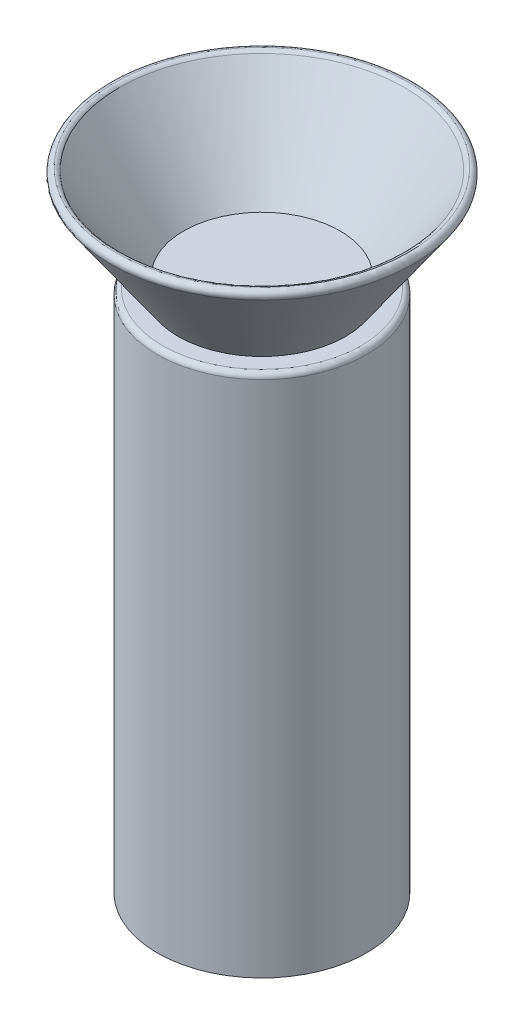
ISO-10303-21;
HEADER;
FILE_DESCRIPTION(('STEP AP214'),'2;1');
FILE_NAME('part.step','',(''),(''),'','','');
FILE_SCHEMA(('AUTOMOTIVE_DESIGN { 1 0 10303 214 1 1 1 1 }'));
ENDSEC;
DATA;
#1=APPLICATION_CONTEXT('core data for automotive mechanical design processes');
#2=APPLICATION_PROTOCOL_DEFINITION('international standard','automotive_design',2000,#1);
#3=PRODUCT_CONTEXT('',#1,'mechanical');
#4=PRODUCT('Part','Part','',(#3));
#5=PRODUCT_RELATED_PRODUCT_CATEGORY('part','',(#4));
#6=PRODUCT_DEFINITION_FORMATION('','',#4);
#7=PRODUCT_DEFINITION_CONTEXT('part definition',#1,'design');
#8=PRODUCT_DEFINITION('design','',#6,#7);
#9=PRODUCT_DEFINITION_SHAPE('','',#8);
#10=(LENGTH_UNIT() NAMED_UNIT(*) SI_UNIT(.MILLI.,.METRE.));
#11=(NAMED_UNIT(*) PLANE_ANGLE_UNIT() SI_UNIT($,.RADIAN.));
#12=(NAMED_UNIT(*) SI_UNIT($,.STERADIAN.) SOLID_ANGLE_UNIT());
#13=UNCERTAINTY_MEASURE_WITH_UNIT(LENGTH_MEASURE(1.E-05),#10,'distance_accuracy_value','');
#14=(GEOMETRIC_REPRESENTATION_CONTEXT(3) GLOBAL_UNCERTAINTY_ASSIGNED_CONTEXT((#13)) GLOBAL_UNIT_ASSIGNED_CONTEXT((#10,
#11,#12)) REPRESENTATION_CONTEXT('',''));
#15=CARTESIAN_POINT('',(0.,0.,0.));
#16=DIRECTION('',(0.,0.,1.));
#17=DIRECTION('',(1.,0.,0.));
#18=AXIS2_PLACEMENT_3D('',#15,#16,#17);
#19=CARTESIAN_POINT('',(0.,120.,0.));
#20=DIRECTION('',(0.,1.,0.));
#21=DIRECTION('',(0.,0.,1.));
#22=AXIS2_PLACEMENT_3D('',#19,#20,#21);
#23=CONICAL_SURFACE('',#22,30.,0.610865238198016);
#24=CARTESIAN_POINT('',(0.,118.426423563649,0.));
#25=DIRECTION('',(0.,-1.,0.));
#26=DIRECTION('',(0.,0.,-1.));
#27=AXIS2_PLACEMENT_3D('',#24,#25,#26);
#28=CIRCLE('',#27,28.8981699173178);
#29=CARTESIAN_POINT('',(0.,118.426423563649,-28.8981699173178));
#30=VERTEX_POINT('',#29);
#31=EDGE_CURVE('E58',#30,#30,#28,.T.);
#32=ORIENTED_EDGE('',*,*,#31,.T.);
#33=EDGE_LOOP('',(#32));
#34=FACE_BOUND('',#33,.T.);
#35=CARTESIAN_POINT('',(0.,100.,0.));
#36=DIRECTION('',(0.,1.,0.));
#37=DIRECTION('',(0.,0.,1.));
#38=AXIS2_PLACEMENT_3D('',#35,#36,#37);
#39=CIRCLE('',#38,15.9958492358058);
#40=CARTESIAN_POINT('',(0.,100.,15.9958492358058));
#41=VERTEX_POINT('',#40);
#42=EDGE_CURVE('E62',#41,#41,#39,.T.);
#43=ORIENTED_EDGE('',*,*,#42,.T.);
#44=EDGE_LOOP('',(#43));
#45=FACE_BOUND('',#44,.T.);
#46=ADVANCED_FACE('F50',(#34,#45),#23,.T.);
#47=CARTESIAN_POINT('',(0.,100.,0.));
#48=DIRECTION('',(0.,1.,0.));
#49=DIRECTION('',(0.,0.,1.));
#50=AXIS2_PLACEMENT_3D('',#47,#48,#49);
#51=PLANE('',#50);
#52=ORIENTED_EDGE('',*,*,#42,.F.);
#53=EDGE_LOOP('',(#52));
#54=FACE_BOUND('',#53,.T.);
#55=ADVANCED_FACE('F87',(#54),#51,.F.);
#56=CARTESIAN_POINT('',(0.,121.147152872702,0.));
#57=DIRECTION('',(0.,1.,0.));
#58=DIRECTION('',(0.,0.,1.));
#59=AXIS2_PLACEMENT_3D('',#56,#57,#58);
#60=CONICAL_SURFACE('',#59,28.361695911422,0.610865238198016);
#61=CARTESIAN_POINT('',(0.,119.573576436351,0.));
#62=DIRECTION('',(0.,1.,0.));
#63=DIRECTION('',(0.,0.,1.));
#64=AXIS2_PLACEMENT_3D('',#61,#62,#63);
#65=CIRCLE('',#64,27.2598658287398);
#66=CARTESIAN_POINT('',(0.,119.573576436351,27.2598658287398));
#67=VERTEX_POINT('',#66);
#68=EDGE_CURVE('E11',#67,#67,#65,.T.);
#69=ORIENTED_EDGE('',*,*,#68,.T.);
#70=EDGE_LOOP('',(#69));
#71=FACE_BOUND('',#70,.T.);
#72=CARTESIAN_POINT('',(0.,102.,0.));
#73=DIRECTION('',(0.,1.,0.));
#74=DIRECTION('',(0.,0.,1.));
#75=AXIS2_PLACEMENT_3D('',#72,#73,#74);
#76=CIRCLE('',#75,14.9547151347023);
#77=CARTESIAN_POINT('',(0.,102.,14.9547151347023));
#78=VERTEX_POINT('',#77);
#79=EDGE_CURVE('E67',#78,#78,#76,.T.);
#80=ORIENTED_EDGE('',*,*,#79,.F.);
#81=EDGE_LOOP('',(#80));
#82=FACE_BOUND('',#81,.T.);
#83=ADVANCED_FACE('F84',(#71,#82),#60,.F.);
#84=CARTESIAN_POINT('',(0.,102.,0.));
#85=DIRECTION('',(0.,1.,0.));
#86=DIRECTION('',(0.,0.,1.));
#87=AXIS2_PLACEMENT_3D('',#84,#85,#86);
#88=PLANE('',#87);
#89=ORIENTED_EDGE('',*,*,#79,.T.);
#90=EDGE_LOOP('',(#89));
#91=FACE_BOUND('',#90,.T.);
#92=ADVANCED_FACE('F77',(#91),#88,.T.);
#93=CARTESIAN_POINT('',(0.,119.,0.));
#94=DIRECTION('',(0.,1.,0.));
#95=DIRECTION('',(0.,0.,1.));
#96=AXIS2_PLACEMENT_3D('',#93,#94,#95);
#97=TOROIDAL_SURFACE('',#96,28.0790178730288,1.);
#98=ORIENTED_EDGE('',*,*,#68,.F.);
#99=EDGE_LOOP('',(#98));
#100=FACE_BOUND('',#99,.T.);
#101=CARTESIAN_POINT('',(0.,120.,0.));
#102=DIRECTION('',(0.,1.,0.));
#103=DIRECTION('',(0.,0.,1.));
#104=AXIS2_PLACEMENT_3D('',#101,#102,#103);
#105=CIRCLE('',#104,28.0790178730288);
#106=CARTESIAN_POINT('',(0.,120.,28.0790178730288));
#107=VERTEX_POINT('',#106);
#108=EDGE_CURVE('E54',#107,#107,#105,.F.);
#109=ORIENTED_EDGE('',*,*,#108,.F.);
#110=EDGE_LOOP('',(#109));
#111=FACE_BOUND('',#110,.T.);
#112=ADVANCED_FACE('F52',(#100,#111),#97,.T.);
#113=CARTESIAN_POINT('',(0.,119.,0.));
#114=DIRECTION('',(0.,1.,0.));
#115=DIRECTION('',(0.,0.,1.));
#116=AXIS2_PLACEMENT_3D('',#113,#114,#115);
#117=TOROIDAL_SURFACE('',#116,28.0790178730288,1.);
#118=ORIENTED_EDGE('',*,*,#31,.F.);
#119=EDGE_LOOP('',(#118));
#120=FACE_BOUND('',#119,.T.);
#121=ORIENTED_EDGE('',*,*,#108,.T.);
#122=EDGE_LOOP('',(#121));
#123=FACE_BOUND('',#122,.T.);
#124=ADVANCED_FACE('F74',(#120,#123),#117,.T.);
#125=CLOSED_SHELL('',(#46,#55,#83,#92,#112,#124));
#126=MANIFOLD_SOLID_BREP('B2',#125);
#127=CARTESIAN_POINT('',(0.,100.,0.));
#128=DIRECTION('',(0.,-1.,0.));
#129=DIRECTION('',(0.,0.,-1.));
#130=AXIS2_PLACEMENT_3D('',#127,#128,#129);
#131=CYLINDRICAL_SURFACE('',#130,20.);
#132=CARTESIAN_POINT('',(0.,99.,0.));
#133=DIRECTION('',(0.,1.,0.));
#134=DIRECTION('',(0.,0.,1.));
#135=AXIS2_PLACEMENT_3D('',#132,#133,#134);
#136=CIRCLE('',#135,20.);
#137=CARTESIAN_POINT('',(0.,99.,20.));
#138=VERTEX_POINT('',#137);
#139=EDGE_CURVE('E49',#138,#138,#136,.F.);
#140=ORIENTED_EDGE('',*,*,#139,.T.);
#141=EDGE_LOOP('',(#140));
#142=FACE_BOUND('',#141,.T.);
#143=CARTESIAN_POINT('',(0.,0.,0.));
#144=DIRECTION('',(0.,1.,0.));
#145=DIRECTION('',(0.,0.,1.));
#146=AXIS2_PLACEMENT_3D('',#143,#144,#145);
#147=CIRCLE('',#146,20.);
#148=CARTESIAN_POINT('',(0.,0.,20.));
#149=VERTEX_POINT('',#148);
#150=EDGE_CURVE('E164',#149,#149,#147,.T.);
#151=ORIENTED_EDGE('',*,*,#150,.T.);
#152=EDGE_LOOP('',(#151));
#153=FACE_BOUND('',#152,.T.);
#154=ADVANCED_FACE('F151',(#142,#153),#131,.T.);
#155=CARTESIAN_POINT('',(0.,100.,0.));
#156=DIRECTION('',(0.,1.,0.));
#157=DIRECTION('',(0.,0.,1.));
#158=AXIS2_PLACEMENT_3D('',#155,#156,#157);
#159=PLANE('',#158);
#160=CARTESIAN_POINT('',(0.,100.,0.));
#161=DIRECTION('',(0.,1.,0.));
#162=DIRECTION('',(0.,0.,1.));
#163=AXIS2_PLACEMENT_3D('',#160,#161,#162);
#164=CIRCLE('',#163,19.);
#165=CARTESIAN_POINT('',(0.,100.,19.));
#166=VERTEX_POINT('',#165);
#167=EDGE_CURVE('E159',#166,#166,#164,.T.);
#168=ORIENTED_EDGE('',*,*,#167,.T.);
#169=EDGE_LOOP('',(#168));
#170=FACE_BOUND('',#169,.T.);
#171=ADVANCED_FACE('F175',(#170),#159,.T.);
#172=CARTESIAN_POINT('',(0.,0.,0.));
#173=DIRECTION('',(0.,1.,0.));
#174=DIRECTION('',(0.,0.,1.));
#175=AXIS2_PLACEMENT_3D('',#172,#173,#174);
#176=PLANE('',#175);
#177=ORIENTED_EDGE('',*,*,#150,.F.);
#178=EDGE_LOOP('',(#177));
#179=FACE_BOUND('',#178,.T.);
#180=ADVANCED_FACE('F173',(#179),#176,.F.);
#181=CARTESIAN_POINT('',(0.,99.,0.));
#182=DIRECTION('',(0.,1.,0.));
#183=DIRECTION('',(0.,0.,1.));
#184=AXIS2_PLACEMENT_3D('',#181,#182,#183);
#185=TOROIDAL_SURFACE('',#184,19.,1.);
#186=ORIENTED_EDGE('',*,*,#139,.F.);
#187=EDGE_LOOP('',(#186));
#188=FACE_BOUND('',#187,.T.);
#189=ORIENTED_EDGE('',*,*,#167,.F.);
#190=EDGE_LOOP('',(#189));
#191=FACE_BOUND('',#190,.T.);
#192=ADVANCED_FACE('F153',(#188,#191),#185,.T.);
#193=CLOSED_SHELL('',(#154,#171,#180,#192));
#194=MANIFOLD_SOLID_BREP('B6',#193);
#195=ADVANCED_BREP_SHAPE_REPRESENTATION('',(#18,#126,#194),#14);
#196=SHAPE_DEFINITION_REPRESENTATION(#9,#195);
ENDSEC;
END-ISO-10303-21;
